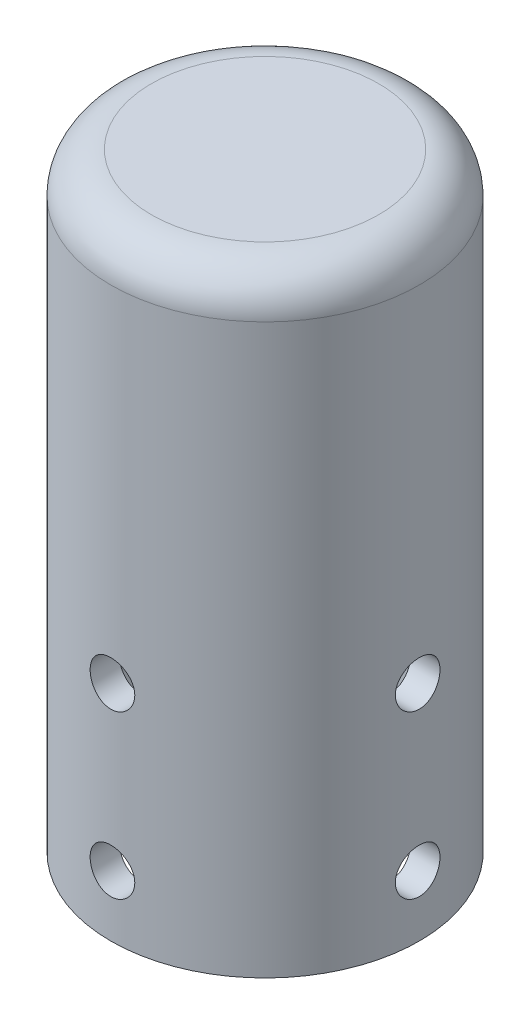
from build123d import *

# Parameters (mm, degrees)
ESQUISSE1_R                  = 38
EXTRUSION1_DEPTH             = 150
CONG_1_R                     = 10
ESQUISSE2_R                  = 31
EXTRUSION2_DEPTH             = 140
CONG_2_R                     = 10
D_GAGEMENT_M101_REACH        = 161.515
D_GAGEMENT_M101_BORE_R       = 5.5
R_P_TITION_CIRCULAIRE1_COUNT = 4


with BuildPart() as part:
    # Esquisse1 → Extrusion1 (new body)
    with BuildSketch(Plane(origin=(0, 0, 0), x_dir=(1, 0, 0), z_dir=(0, 1, 0))):
        with Locations(Location((0, 0, 0), (0, 0, 270))):
            Circle(ESQUISSE1_R)
    extrude(amount=EXTRUSION1_DEPTH)

    # Cong_1
    cong_1_edges = [part.edges().sort_by_distance(p)[0] for p in [
        (0, 150, -38),
    ]]
    fillet(cong_1_edges, radius=CONG_1_R)

    # Esquisse2 → Extrusion2 (cut)
    with BuildSketch(Plane.XZ):
        with Locations(Location((0, 0, 0), (0, 0, 270))):
            Circle(ESQUISSE2_R)
    extrude(amount=-EXTRUSION2_DEPTH, mode=Mode.SUBTRACT)

    # Cong_2
    cong_2_edges = [part.edges().sort_by_distance(p)[0] for p in [
        (0, 140, 31),
    ]]
    fillet(cong_2_edges, radius=CONG_2_R)

    # D_gagement M101 bore (on position points) → D_gagement M101 (cut, up to next)
    with BuildSketch(Plane(origin=(0, 15, 38), x_dir=(1, 0, 0), z_dir=(0, 0, 1)), mode=Mode.PRIVATE) as d_gagement_m101_sk1:
        Circle(D_GAGEMENT_M101_BORE_R)
    d_gagement_m101_tool1 = extrude(d_gagement_m101_sk1.sketch, amount=-D_GAGEMENT_M101_REACH, mode=Mode.PRIVATE) & part.part
    # D_gagement M101 bore (on position points) → D_gagement M101 (cut, up to next)
    with BuildSketch(Plane(origin=(0, 15, 38), x_dir=(1, 0, 0), z_dir=(0, 0, 1)), mode=Mode.PRIVATE) as d_gagement_m101_sk2:
        with Locations((0, 40)):
            Circle(D_GAGEMENT_M101_BORE_R)
    d_gagement_m101_tool2 = extrude(d_gagement_m101_sk2.sketch, amount=-D_GAGEMENT_M101_REACH, mode=Mode.PRIVATE) & part.part
    d_gagement_m101_1 = d_gagement_m101_tool1.solids().sort_by_distance((0, 15, 38))[0]
    add(d_gagement_m101_1, mode=Mode.SUBTRACT)
    d_gagement_m101_2 = d_gagement_m101_tool2.solids().sort_by_distance((0, 55, 38))[0]
    add(d_gagement_m101_2, mode=Mode.SUBTRACT)
    d_gagement_m101 = d_gagement_m101_1 + d_gagement_m101_2  # D_gagement M101 as one shape, for the pattern or mirror that repeats it

    # R_p_tition circulaire1: D_gagement M101 ×4 about axis
    r_p_tition_circulaire1_axis = Axis((0, 150, 0), (0, -1, 0))
    for i in range(1, R_P_TITION_CIRCULAIRE1_COUNT):
        add(d_gagement_m101.rotate(r_p_tition_circulaire1_axis, i * 360 / R_P_TITION_CIRCULAIRE1_COUNT), mode=Mode.SUBTRACT)


solid = part.part
